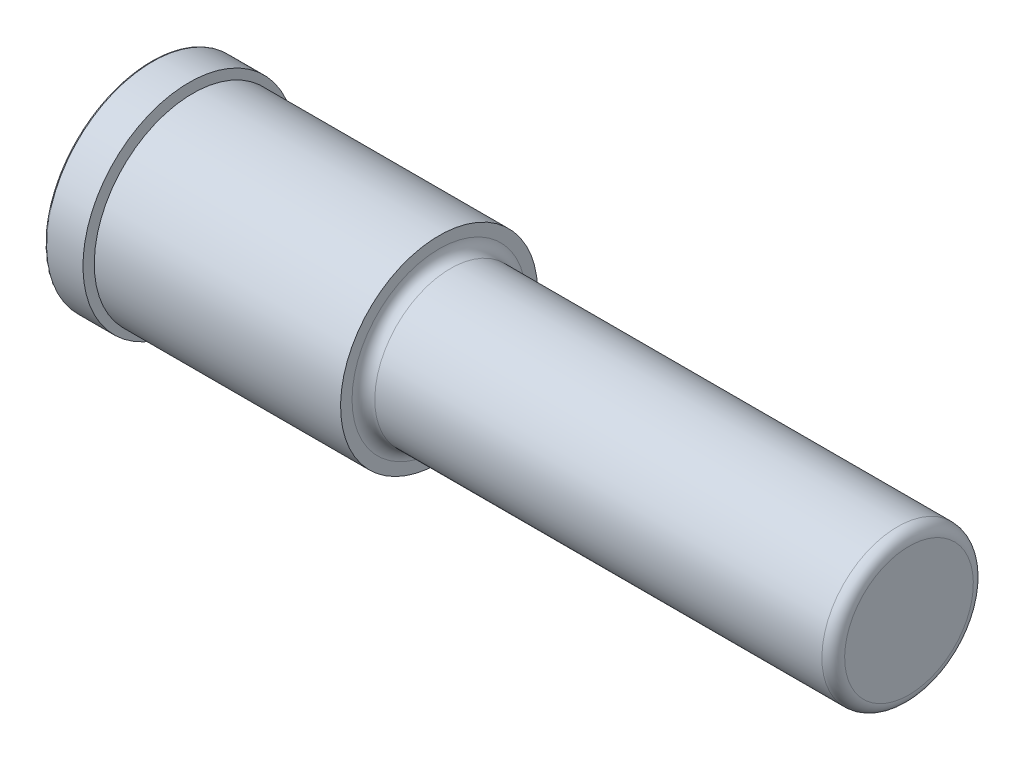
ISO-10303-21;
HEADER;
FILE_DESCRIPTION(('STEP AP214'),'2;1');
FILE_NAME('part.step','',(''),(''),'','','');
FILE_SCHEMA(('AUTOMOTIVE_DESIGN { 1 0 10303 214 1 1 1 1 }'));
ENDSEC;
DATA;
#1=APPLICATION_CONTEXT('core data for automotive mechanical design processes');
#2=APPLICATION_PROTOCOL_DEFINITION('international standard','automotive_design',2000,#1);
#3=PRODUCT_CONTEXT('',#1,'mechanical');
#4=PRODUCT('Part','Part','',(#3));
#5=PRODUCT_RELATED_PRODUCT_CATEGORY('part','',(#4));
#6=PRODUCT_DEFINITION_FORMATION('','',#4);
#7=PRODUCT_DEFINITION_CONTEXT('part definition',#1,'design');
#8=PRODUCT_DEFINITION('design','',#6,#7);
#9=PRODUCT_DEFINITION_SHAPE('','',#8);
#10=(LENGTH_UNIT() NAMED_UNIT(*) SI_UNIT(.MILLI.,.METRE.));
#11=(NAMED_UNIT(*) PLANE_ANGLE_UNIT() SI_UNIT($,.RADIAN.));
#12=(NAMED_UNIT(*) SI_UNIT($,.STERADIAN.) SOLID_ANGLE_UNIT());
#13=UNCERTAINTY_MEASURE_WITH_UNIT(LENGTH_MEASURE(1.E-05),#10,'distance_accuracy_value','');
#14=(GEOMETRIC_REPRESENTATION_CONTEXT(3) GLOBAL_UNCERTAINTY_ASSIGNED_CONTEXT((#13)) GLOBAL_UNIT_ASSIGNED_CONTEXT((#10,
#11,#12)) REPRESENTATION_CONTEXT('',''));
#15=CARTESIAN_POINT('',(0.,0.,0.));
#16=DIRECTION('',(0.,0.,1.));
#17=DIRECTION('',(1.,0.,0.));
#18=AXIS2_PLACEMENT_3D('',#15,#16,#17);
#19=CARTESIAN_POINT('',(0.,0.,0.));
#20=DIRECTION('',(1.,0.,0.));
#21=DIRECTION('',(0.,1.,0.));
#22=AXIS2_PLACEMENT_3D('',#19,#20,#21);
#23=PLANE('',#22);
#24=CARTESIAN_POINT('',(0.,0.,0.));
#25=DIRECTION('',(-1.,0.,0.));
#26=DIRECTION('',(0.,-1.,0.));
#27=AXIS2_PLACEMENT_3D('',#24,#25,#26);
#28=CIRCLE('',#27,21.9075);
#29=CARTESIAN_POINT('',(0.,-21.9075,0.));
#30=VERTEX_POINT('',#29);
#31=EDGE_CURVE('E10',#30,#30,#28,.T.);
#32=ORIENTED_EDGE('',*,*,#31,.T.);
#33=EDGE_LOOP('',(#32));
#34=FACE_BOUND('',#33,.T.);
#35=ADVANCED_FACE('F28',(#34),#23,.F.);
#36=CARTESIAN_POINT('',(0.317500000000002,0.,0.));
#37=DIRECTION('',(-1.,0.,0.));
#38=DIRECTION('',(0.,-1.,0.));
#39=AXIS2_PLACEMENT_3D('',#36,#37,#38);
#40=TOROIDAL_SURFACE('',#39,21.9075,0.317500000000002);
#41=ORIENTED_EDGE('',*,*,#31,.F.);
#42=EDGE_LOOP('',(#41));
#43=FACE_BOUND('',#42,.T.);
#44=CARTESIAN_POINT('',(0.317499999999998,0.,0.));
#45=DIRECTION('',(-1.,0.,0.));
#46=DIRECTION('',(0.,-1.,0.));
#47=AXIS2_PLACEMENT_3D('',#44,#45,#46);
#48=CIRCLE('',#47,22.225);
#49=CARTESIAN_POINT('',(0.317499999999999,-22.225,0.));
#50=VERTEX_POINT('',#49);
#51=EDGE_CURVE('E34',#50,#50,#48,.T.);
#52=ORIENTED_EDGE('',*,*,#51,.T.);
#53=EDGE_LOOP('',(#52));
#54=FACE_BOUND('',#53,.T.);
#55=ADVANCED_FACE('F81',(#43,#54),#40,.T.);
#56=CARTESIAN_POINT('',(158.75,0.,0.));
#57=DIRECTION('',(-1.,0.,0.));
#58=DIRECTION('',(0.,-1.,0.));
#59=AXIS2_PLACEMENT_3D('',#56,#57,#58);
#60=CYLINDRICAL_SURFACE('',#59,22.225);
#61=ORIENTED_EDGE('',*,*,#51,.F.);
#62=EDGE_LOOP('',(#61));
#63=FACE_BOUND('',#62,.T.);
#64=CARTESIAN_POINT('',(7.93749999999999,0.,0.));
#65=DIRECTION('',(-1.,0.,0.));
#66=DIRECTION('',(0.,-1.,0.));
#67=AXIS2_PLACEMENT_3D('',#64,#65,#66);
#68=CIRCLE('',#67,22.225);
#69=CARTESIAN_POINT('',(7.93749999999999,-22.225,0.));
#70=VERTEX_POINT('',#69);
#71=EDGE_CURVE('E38',#70,#70,#68,.T.);
#72=ORIENTED_EDGE('',*,*,#71,.T.);
#73=EDGE_LOOP('',(#72));
#74=FACE_BOUND('',#73,.T.);
#75=ADVANCED_FACE('F85',(#63,#74),#60,.T.);
#76=CARTESIAN_POINT('',(7.9375,22.225,0.));
#77=DIRECTION('',(-1.,0.,0.));
#78=DIRECTION('',(0.,-1.,0.));
#79=AXIS2_PLACEMENT_3D('',#76,#77,#78);
#80=PLANE('',#79);
#81=ORIENTED_EDGE('',*,*,#71,.F.);
#82=EDGE_LOOP('',(#81));
#83=FACE_BOUND('',#82,.T.);
#84=CARTESIAN_POINT('',(7.93749999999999,0.,0.));
#85=DIRECTION('',(-1.,0.,0.));
#86=DIRECTION('',(0.,-1.,0.));
#87=AXIS2_PLACEMENT_3D('',#84,#85,#86);
#88=CIRCLE('',#87,19.506184);
#89=CARTESIAN_POINT('',(7.93749999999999,-19.506184,0.));
#90=VERTEX_POINT('',#89);
#91=EDGE_CURVE('E42',#90,#90,#88,.T.);
#92=ORIENTED_EDGE('',*,*,#91,.T.);
#93=EDGE_LOOP('',(#92));
#94=FACE_BOUND('',#93,.T.);
#95=ADVANCED_FACE('F90',(#83,#94),#80,.F.);
#96=CARTESIAN_POINT('',(158.75,0.,0.));
#97=DIRECTION('',(-1.,0.,0.));
#98=DIRECTION('',(0.,-1.,0.));
#99=AXIS2_PLACEMENT_3D('',#96,#97,#98);
#100=CYLINDRICAL_SURFACE('',#99,19.506184);
#101=ORIENTED_EDGE('',*,*,#91,.F.);
#102=EDGE_LOOP('',(#101));
#103=FACE_BOUND('',#102,.T.);
#104=CARTESIAN_POINT('',(8.73125,0.,0.));
#105=DIRECTION('',(-1.,0.,0.));
#106=DIRECTION('',(0.,-1.,0.));
#107=AXIS2_PLACEMENT_3D('',#104,#105,#106);
#108=CIRCLE('',#107,19.506184);
#109=CARTESIAN_POINT('',(8.73125,-19.506184,0.));
#110=VERTEX_POINT('',#109);
#111=EDGE_CURVE('E47',#110,#110,#108,.T.);
#112=ORIENTED_EDGE('',*,*,#111,.T.);
#113=EDGE_LOOP('',(#112));
#114=FACE_BOUND('',#113,.T.);
#115=ADVANCED_FACE('F96',(#103,#114),#100,.T.);
#116=CARTESIAN_POINT('',(8.73125,19.506184,0.));
#117=DIRECTION('',(1.,0.,0.));
#118=DIRECTION('',(0.,1.,0.));
#119=AXIS2_PLACEMENT_3D('',#116,#117,#118);
#120=PLANE('',#119);
#121=ORIENTED_EDGE('',*,*,#111,.F.);
#122=EDGE_LOOP('',(#121));
#123=FACE_BOUND('',#122,.T.);
#124=CARTESIAN_POINT('',(8.73125,0.,0.));
#125=DIRECTION('',(-1.,0.,0.));
#126=DIRECTION('',(0.,-1.,0.));
#127=AXIS2_PLACEMENT_3D('',#124,#125,#126);
#128=CIRCLE('',#127,20.6502);
#129=CARTESIAN_POINT('',(8.73125,-20.6502,0.));
#130=VERTEX_POINT('',#129);
#131=EDGE_CURVE('E50',#130,#130,#128,.T.);
#132=ORIENTED_EDGE('',*,*,#131,.T.);
#133=EDGE_LOOP('',(#132));
#134=FACE_BOUND('',#133,.T.);
#135=ADVANCED_FACE('F100',(#123,#134),#120,.F.);
#136=CARTESIAN_POINT('',(158.75,0.,0.));
#137=DIRECTION('',(-1.,0.,0.));
#138=DIRECTION('',(0.,-1.,0.));
#139=AXIS2_PLACEMENT_3D('',#136,#137,#138);
#140=CYLINDRICAL_SURFACE('',#139,20.6502);
#141=ORIENTED_EDGE('',*,*,#131,.F.);
#142=EDGE_LOOP('',(#141));
#143=FACE_BOUND('',#142,.T.);
#144=CARTESIAN_POINT('',(60.325,0.,0.));
#145=DIRECTION('',(-1.,0.,0.));
#146=DIRECTION('',(0.,-1.,0.));
#147=AXIS2_PLACEMENT_3D('',#144,#145,#146);
#148=CIRCLE('',#147,20.6502);
#149=CARTESIAN_POINT('',(60.325,-20.6502,0.));
#150=VERTEX_POINT('',#149);
#151=EDGE_CURVE('E53',#150,#150,#148,.T.);
#152=ORIENTED_EDGE('',*,*,#151,.T.);
#153=EDGE_LOOP('',(#152));
#154=FACE_BOUND('',#153,.T.);
#155=ADVANCED_FACE('F104',(#143,#154),#140,.T.);
#156=CARTESIAN_POINT('',(60.325,20.6502,0.));
#157=DIRECTION('',(-1.,0.,0.));
#158=DIRECTION('',(0.,-1.,0.));
#159=AXIS2_PLACEMENT_3D('',#156,#157,#158);
#160=PLANE('',#159);
#161=ORIENTED_EDGE('',*,*,#151,.F.);
#162=EDGE_LOOP('',(#161));
#163=FACE_BOUND('',#162,.T.);
#164=CARTESIAN_POINT('',(60.325,0.,0.));
#165=DIRECTION('',(-1.,0.,0.));
#166=DIRECTION('',(0.,-1.,0.));
#167=AXIS2_PLACEMENT_3D('',#164,#165,#166);
#168=CIRCLE('',#167,18.24355);
#169=CARTESIAN_POINT('',(60.325,-18.24355,0.));
#170=VERTEX_POINT('',#169);
#171=EDGE_CURVE('E56',#170,#170,#168,.T.);
#172=ORIENTED_EDGE('',*,*,#171,.T.);
#173=EDGE_LOOP('',(#172));
#174=FACE_BOUND('',#173,.T.);
#175=ADVANCED_FACE('F108',(#163,#174),#160,.F.);
#176=CARTESIAN_POINT('',(62.70625,0.,0.));
#177=DIRECTION('',(-1.,0.,0.));
#178=DIRECTION('',(0.,-1.,0.));
#179=AXIS2_PLACEMENT_3D('',#176,#177,#178);
#180=TOROIDAL_SURFACE('',#179,18.24355,2.38125);
#181=ORIENTED_EDGE('',*,*,#171,.F.);
#182=EDGE_LOOP('',(#181));
#183=FACE_BOUND('',#182,.T.);
#184=CARTESIAN_POINT('',(62.70625,0.,0.));
#185=DIRECTION('',(-1.,0.,0.));
#186=DIRECTION('',(0.,-1.,0.));
#187=AXIS2_PLACEMENT_3D('',#184,#185,#186);
#188=CIRCLE('',#187,15.8623);
#189=CARTESIAN_POINT('',(62.70625,-15.8623,0.));
#190=VERTEX_POINT('',#189);
#191=EDGE_CURVE('E59',#190,#190,#188,.T.);
#192=ORIENTED_EDGE('',*,*,#191,.T.);
#193=EDGE_LOOP('',(#192));
#194=FACE_BOUND('',#193,.T.);
#195=ADVANCED_FACE('F112',(#183,#194),#180,.F.);
#196=CARTESIAN_POINT('',(158.75,0.,0.));
#197=DIRECTION('',(-1.,0.,0.));
#198=DIRECTION('',(0.,-1.,0.));
#199=AXIS2_PLACEMENT_3D('',#196,#197,#198);
#200=CYLINDRICAL_SURFACE('',#199,15.8623);
#201=ORIENTED_EDGE('',*,*,#191,.F.);
#202=EDGE_LOOP('',(#201));
#203=FACE_BOUND('',#202,.T.);
#204=CARTESIAN_POINT('',(156.36875,0.,0.));
#205=DIRECTION('',(-1.,0.,0.));
#206=DIRECTION('',(0.,-1.,0.));
#207=AXIS2_PLACEMENT_3D('',#204,#205,#206);
#208=CIRCLE('',#207,15.8623);
#209=CARTESIAN_POINT('',(156.36875,-15.8623,0.));
#210=VERTEX_POINT('',#209);
#211=EDGE_CURVE('E62',#210,#210,#208,.T.);
#212=ORIENTED_EDGE('',*,*,#211,.T.);
#213=EDGE_LOOP('',(#212));
#214=FACE_BOUND('',#213,.T.);
#215=ADVANCED_FACE('F77',(#203,#214),#200,.T.);
#216=CARTESIAN_POINT('',(156.36875,0.,0.));
#217=DIRECTION('',(-1.,0.,0.));
#218=DIRECTION('',(0.,-1.,0.));
#219=AXIS2_PLACEMENT_3D('',#216,#217,#218);
#220=TOROIDAL_SURFACE('',#219,13.48105,2.38124999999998);
#221=ORIENTED_EDGE('',*,*,#211,.F.);
#222=EDGE_LOOP('',(#221));
#223=FACE_BOUND('',#222,.T.);
#224=CARTESIAN_POINT('',(158.75,0.,0.));
#225=DIRECTION('',(-1.,0.,0.));
#226=DIRECTION('',(0.,-1.,0.));
#227=AXIS2_PLACEMENT_3D('',#224,#225,#226);
#228=CIRCLE('',#227,13.48105);
#229=CARTESIAN_POINT('',(158.75,-13.48105,0.));
#230=VERTEX_POINT('',#229);
#231=EDGE_CURVE('E65',#230,#230,#228,.T.);
#232=ORIENTED_EDGE('',*,*,#231,.T.);
#233=EDGE_LOOP('',(#232));
#234=FACE_BOUND('',#233,.T.);
#235=ADVANCED_FACE('F69',(#223,#234),#220,.T.);
#236=CARTESIAN_POINT('',(158.75,13.48105,0.));
#237=DIRECTION('',(-1.,0.,0.));
#238=DIRECTION('',(0.,-1.,0.));
#239=AXIS2_PLACEMENT_3D('',#236,#237,#238);
#240=PLANE('',#239);
#241=ORIENTED_EDGE('',*,*,#231,.F.);
#242=EDGE_LOOP('',(#241));
#243=FACE_BOUND('',#242,.T.);
#244=ADVANCED_FACE('F71',(#243),#240,.F.);
#245=CLOSED_SHELL('',(#35,#55,#75,#95,#115,#135,#155,#175,#195,#215,#235,#244));
#246=MANIFOLD_SOLID_BREP('B2',#245);
#247=ADVANCED_BREP_SHAPE_REPRESENTATION('',(#18,#246),#14);
#248=SHAPE_DEFINITION_REPRESENTATION(#9,#247);
ENDSEC;
END-ISO-10303-21;
